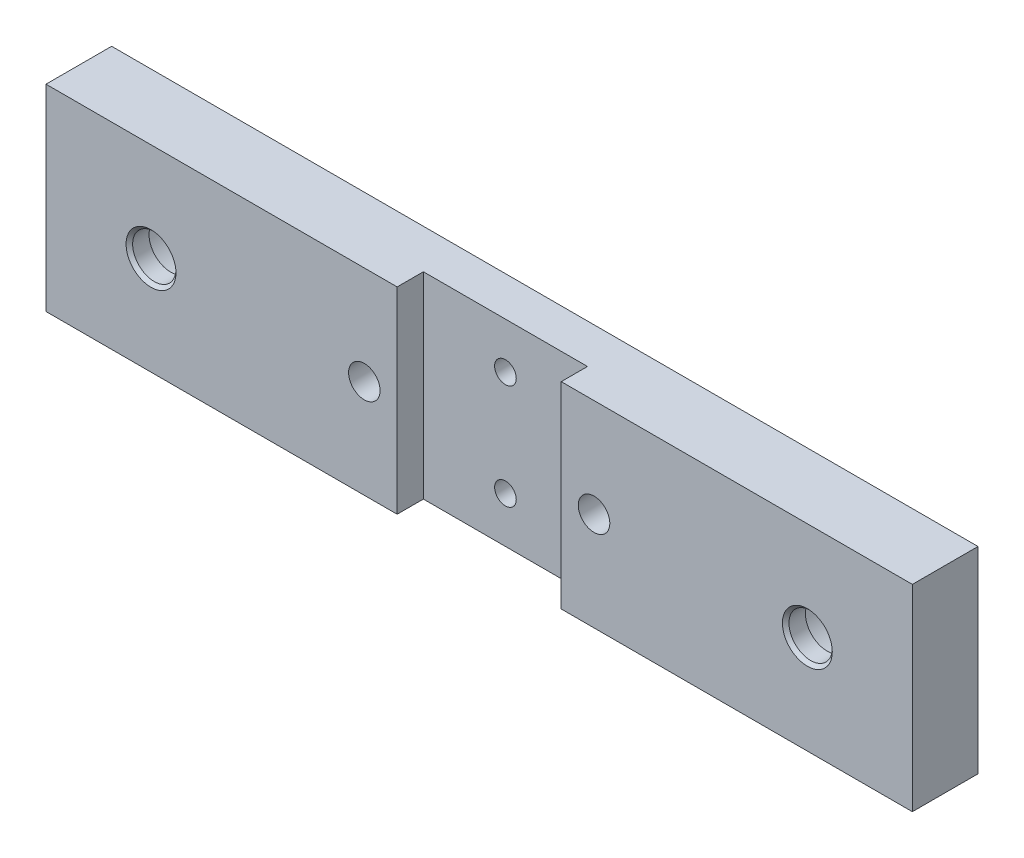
from build123d import *

# Parameters (mm, degrees)
ESQUISSE1_W                                        = 132
ESQUISSE1_H                                        = 30
EXTRUSION1_DEPTH                                   = 10
ESQUISSE2_W                                        = 25
ESQUISSE2_H                                        = 63.286587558
ENL_V_MAT_EXTRU_1_DEPTH                            = 4
CHAMBRAGE_POUR_VIS_T_TE_CYLINDRIQUE_FE_D           = 6.6
CHAMBRAGE_POUR_VIS_T_TE_CYLINDRIQUE_FE_DEPTH       = 10
CHAMBRAGE_POUR_VIS_T_TE_CYLINDRIQUE_FE_CBORE_D     = 12.5
CHAMBRAGE_POUR_VIS_T_TE_CYLINDRIQUE_FE_CBORE_DEPTH = 7
CHAMBRAGE_POUR_VIS_T_TE_CYLINDRIQUE_FE_TIP         = 1.982840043
CHANFREIN1_SIZE                                    = 0.5
TROU_TARAUD_M6X1_01_D                              = 4.8
TROU_TARAUD_M4X0_71_D                              = 3.3


with BuildPart() as part:
    # Esquisse1 → Extrusion1 (new body)
    with BuildSketch(Plane.XY):
        Rectangle(ESQUISSE1_W, ESQUISSE1_H)
    extrude(amount=EXTRUSION1_DEPTH)

    # Esquisse2 → Enl_v. mat.-Extru.1 (cut)
    with BuildSketch(Plane.XY.offset(10)):
        with Locations((0, -0.316432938)):
            Rectangle(ESQUISSE2_W, ESQUISSE2_H)
    extrude(amount=-ENL_V_MAT_EXTRU_1_DEPTH, mode=Mode.SUBTRACT)

    # Chambrage pour vis _ t_te cylindrique fe
    with Locations(Plane(origin=(0, 0, 0), x_dir=(-1, 0, 0), z_dir=(0, 0, -1))):
        with Locations((50, 0), (-50, 0)):
            CounterBoreHole(CHAMBRAGE_POUR_VIS_T_TE_CYLINDRIQUE_FE_D / 2, CHAMBRAGE_POUR_VIS_T_TE_CYLINDRIQUE_FE_CBORE_D / 2, CHAMBRAGE_POUR_VIS_T_TE_CYLINDRIQUE_FE_CBORE_DEPTH, depth=CHAMBRAGE_POUR_VIS_T_TE_CYLINDRIQUE_FE_DEPTH)
            with Locations((0, 0, -(CHAMBRAGE_POUR_VIS_T_TE_CYLINDRIQUE_FE_DEPTH + CHAMBRAGE_POUR_VIS_T_TE_CYLINDRIQUE_FE_TIP / 2))):  # 118° drill point
                Cone(0, CHAMBRAGE_POUR_VIS_T_TE_CYLINDRIQUE_FE_D / 2, CHAMBRAGE_POUR_VIS_T_TE_CYLINDRIQUE_FE_TIP, mode=Mode.SUBTRACT)

    # Chanfrein1
    chanfrein1_edges = [part.edges().sort_by_distance(p)[0] for p in [
        (-53.3, 0, 10),
        (-43.75, 0, 0),
        (46.7, 0, 10),
        (56.25, 0, 0),
    ]]
    chamfer(chanfrein1_edges, length=CHANFREIN1_SIZE)

    # Trou taraud_ M6x1.01 (through all)
    with Locations(Plane(origin=(0, 0, 0), x_dir=(-1, 0, 0), z_dir=(0, 0, -1))):
        with Locations((17.5, 0), (-17.5, 0)):
            Hole(TROU_TARAUD_M6X1_01_D / 2)

    # Trou taraud_ M4x0.71 (through all)
    with Locations(Plane(origin=(0, 0, 0), x_dir=(-1, 0, 0), z_dir=(0, 0, -1))):
        with Locations((0, 8), (0, -8)):
            Hole(TROU_TARAUD_M4X0_71_D / 2)


solid = part.part
